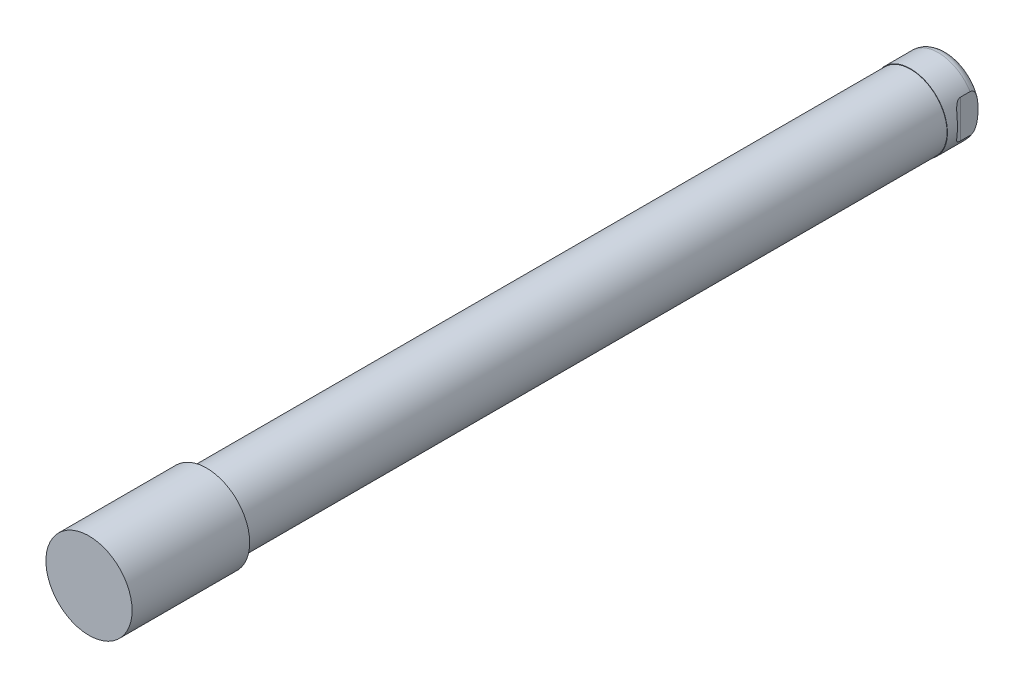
ISO-10303-21;
HEADER;
FILE_DESCRIPTION(('STEP AP214'),'2;1');
FILE_NAME('part.step','',(''),(''),'','','');
FILE_SCHEMA(('AUTOMOTIVE_DESIGN { 1 0 10303 214 1 1 1 1 }'));
ENDSEC;
DATA;
#1=APPLICATION_CONTEXT('core data for automotive mechanical design processes');
#2=APPLICATION_PROTOCOL_DEFINITION('international standard','automotive_design',2000,#1);
#3=PRODUCT_CONTEXT('',#1,'mechanical');
#4=PRODUCT('Part','Part','',(#3));
#5=PRODUCT_RELATED_PRODUCT_CATEGORY('part','',(#4));
#6=PRODUCT_DEFINITION_FORMATION('','',#4);
#7=PRODUCT_DEFINITION_CONTEXT('part definition',#1,'design');
#8=PRODUCT_DEFINITION('design','',#6,#7);
#9=PRODUCT_DEFINITION_SHAPE('','',#8);
#10=(LENGTH_UNIT() NAMED_UNIT(*) SI_UNIT(.MILLI.,.METRE.));
#11=(NAMED_UNIT(*) PLANE_ANGLE_UNIT() SI_UNIT($,.RADIAN.));
#12=(NAMED_UNIT(*) SI_UNIT($,.STERADIAN.) SOLID_ANGLE_UNIT());
#13=UNCERTAINTY_MEASURE_WITH_UNIT(LENGTH_MEASURE(1.E-05),#10,'distance_accuracy_value','');
#14=(GEOMETRIC_REPRESENTATION_CONTEXT(3) GLOBAL_UNCERTAINTY_ASSIGNED_CONTEXT((#13)) GLOBAL_UNIT_ASSIGNED_CONTEXT((#10,
#11,#12)) REPRESENTATION_CONTEXT('',''));
#15=CARTESIAN_POINT('',(0.,0.,0.));
#16=DIRECTION('',(0.,0.,1.));
#17=DIRECTION('',(1.,0.,0.));
#18=AXIS2_PLACEMENT_3D('',#15,#16,#17);
#19=CARTESIAN_POINT('',(0.,9.8171,-245.0973999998));
#20=DIRECTION('',(0.,0.,-1.));
#21=DIRECTION('',(-1.,0.,0.));
#22=AXIS2_PLACEMENT_3D('',#19,#20,#21);
#23=PLANE('',#22);
#24=CARTESIAN_POINT('',(0.,0.,-245.0973999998));
#25=DIRECTION('',(0.,0.,-1.));
#26=DIRECTION('',(-1.,0.,0.));
#27=AXIS2_PLACEMENT_3D('',#24,#25,#26);
#28=CIRCLE('',#27,12.69238);
#29=CARTESIAN_POINT('',(-12.69238,0.,-245.0973999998));
#30=VERTEX_POINT('',#29);
#31=EDGE_CURVE('E10',#30,#30,#28,.F.);
#32=ORIENTED_EDGE('',*,*,#31,.F.);
#33=EDGE_LOOP('',(#32));
#34=FACE_BOUND('',#33,.T.);
#35=CARTESIAN_POINT('',(0.,0.,-245.0973999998));
#36=DIRECTION('',(0.,0.,-1.));
#37=DIRECTION('',(-1.,0.,0.));
#38=AXIS2_PLACEMENT_3D('',#35,#36,#37);
#39=CIRCLE('',#38,12.827);
#40=CARTESIAN_POINT('',(-12.827,0.,-245.0973999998));
#41=VERTEX_POINT('',#40);
#42=EDGE_CURVE('E74',#41,#41,#39,.F.);
#43=ORIENTED_EDGE('',*,*,#42,.T.);
#44=EDGE_LOOP('',(#43));
#45=FACE_BOUND('',#44,.T.);
#46=ADVANCED_FACE('F16',(#34,#45),#23,.F.);
#47=CARTESIAN_POINT('',(0.,0.,-236.058911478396));
#48=DIRECTION('',(0.,0.,-1.));
#49=DIRECTION('',(-1.,0.,0.));
#50=AXIS2_PLACEMENT_3D('',#47,#48,#49);
#51=CONICAL_SURFACE('',#50,0.,1.02974425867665);
#52=CARTESIAN_POINT('',(0.,0.,-239.2973999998));
#53=DIRECTION('',(0.,0.,1.));
#54=DIRECTION('',(1.,0.,0.));
#55=AXIS2_PLACEMENT_3D('',#52,#53,#54);
#56=CIRCLE('',#55,5.38975);
#57=CARTESIAN_POINT('',(5.38975,0.,-239.2973999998));
#58=VERTEX_POINT('',#57);
#59=EDGE_CURVE('E89',#58,#58,#56,.T.);
#60=ORIENTED_EDGE('',*,*,#59,.F.);
#61=EDGE_LOOP('',(#60));
#62=FACE_BOUND('',#61,.T.);
#63=CARTESIAN_POINT('',(0.,0.,-236.058911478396));
#64=VERTEX_POINT('',#63);
#65=VERTEX_LOOP('',#64);
#66=FACE_BOUND('',#65,.T.);
#67=ADVANCED_FACE('F125',(#62,#66),#51,.F.);
#68=CARTESIAN_POINT('',(0.,0.,-219.953809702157));
#69=DIRECTION('',(0.,0.,1.));
#70=DIRECTION('',(1.,0.,0.));
#71=AXIS2_PLACEMENT_3D('',#68,#69,#70);
#72=CYLINDRICAL_SURFACE('',#71,5.38975);
#73=CARTESIAN_POINT('',(0.,0.,-257.0971499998));
#74=DIRECTION('',(0.,0.,1.));
#75=DIRECTION('',(1.,0.,0.));
#76=AXIS2_PLACEMENT_3D('',#73,#74,#75);
#77=CIRCLE('',#76,5.38975);
#78=CARTESIAN_POINT('',(5.38975,0.,-257.0971499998));
#79=VERTEX_POINT('',#78);
#80=EDGE_CURVE('E92',#79,#79,#77,.T.);
#81=ORIENTED_EDGE('',*,*,#80,.F.);
#82=EDGE_LOOP('',(#81));
#83=FACE_BOUND('',#82,.T.);
#84=ORIENTED_EDGE('',*,*,#59,.T.);
#85=EDGE_LOOP('',(#84));
#86=FACE_BOUND('',#85,.T.);
#87=ADVANCED_FACE('F128',(#83,#86),#72,.F.);
#88=CARTESIAN_POINT('',(0.,0.,-257.0971499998));
#89=DIRECTION('',(0.,0.,-1.));
#90=DIRECTION('',(-1.,0.,0.));
#91=AXIS2_PLACEMENT_3D('',#88,#89,#90);
#92=CONICAL_SURFACE('',#91,5.38975,0.785398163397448);
#93=CARTESIAN_POINT('',(0.,0.,-257.7973999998));
#94=DIRECTION('',(0.,0.,1.));
#95=DIRECTION('',(1.,0.,0.));
#96=AXIS2_PLACEMENT_3D('',#93,#94,#95);
#97=CIRCLE('',#96,6.09);
#98=CARTESIAN_POINT('',(6.09,0.,-257.7973999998));
#99=VERTEX_POINT('',#98);
#100=EDGE_CURVE('E95',#99,#99,#97,.T.);
#101=ORIENTED_EDGE('',*,*,#100,.F.);
#102=EDGE_LOOP('',(#101));
#103=FACE_BOUND('',#102,.T.);
#104=ORIENTED_EDGE('',*,*,#80,.T.);
#105=EDGE_LOOP('',(#104));
#106=FACE_BOUND('',#105,.T.);
#107=ADVANCED_FACE('F132',(#103,#106),#92,.F.);
#108=CARTESIAN_POINT('',(0.,9.827,-257.7973999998));
#109=DIRECTION('',(0.,0.,1.));
#110=DIRECTION('',(1.,0.,0.));
#111=AXIS2_PLACEMENT_3D('',#108,#109,#110);
#112=PLANE('',#111);
#113=CARTESIAN_POINT('',(0.,0.,-257.7973999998));
#114=DIRECTION('',(0.,0.,1.));
#115=DIRECTION('',(1.,0.,0.));
#116=AXIS2_PLACEMENT_3D('',#113,#114,#115);
#117=CIRCLE('',#116,9.827);
#118=CARTESIAN_POINT('',(9.827,0.,-257.7973999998));
#119=VERTEX_POINT('',#118);
#120=EDGE_CURVE('E98',#119,#119,#117,.T.);
#121=ORIENTED_EDGE('',*,*,#120,.F.);
#122=EDGE_LOOP('',(#121));
#123=FACE_BOUND('',#122,.T.);
#124=ORIENTED_EDGE('',*,*,#100,.T.);
#125=EDGE_LOOP('',(#124));
#126=FACE_BOUND('',#125,.T.);
#127=ADVANCED_FACE('F135',(#123,#126),#112,.F.);
#128=CARTESIAN_POINT('',(14.175,-13.589,-251.4473999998));
#129=DIRECTION('',(0.,1.,0.));
#130=DIRECTION('',(0.,0.,1.));
#131=AXIS2_PLACEMENT_3D('',#128,#129,#130);
#132=CYLINDRICAL_SURFACE('',#131,3.175);
#133=DIRECTION('',(0.,1.,0.));
#134=VECTOR('',#133,1.);
#135=CARTESIAN_POINT('',(11.,-13.589,-251.4473999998));
#136=LINE('',#135,#134);
#137=CARTESIAN_POINT('',(11.,-6.59787306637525,-251.4473999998));
#138=VERTEX_POINT('',#137);
#139=CARTESIAN_POINT('',(11.,6.59787306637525,-251.4473999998));
#140=VERTEX_POINT('',#139);
#141=EDGE_CURVE('E66',#138,#140,#136,.T.);
#142=ORIENTED_EDGE('',*,*,#141,.T.);
#143=CARTESIAN_POINT('',(12.827,0.,-254.322034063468));
#144=CARTESIAN_POINT('',(12.8270006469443,-0.26870639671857,-254.322032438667));
#145=CARTESIAN_POINT('',(12.8185521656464,-0.537405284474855,-254.318117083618));
#146=CARTESIAN_POINT('',(12.7848168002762,-1.07356137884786,-254.301935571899));
#147=CARTESIAN_POINT('',(12.7595266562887,-1.34101833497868,-254.289667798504));
#148=CARTESIAN_POINT('',(12.6924264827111,-1.87235964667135,-254.255249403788));
#149=CARTESIAN_POINT('',(12.6506688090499,-2.13625260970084,-254.233130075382));
#150=CARTESIAN_POINT('',(12.551075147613,-2.65955990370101,-254.176285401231));
#151=CARTESIAN_POINT('',(12.4932481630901,-2.91897665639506,-254.141567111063));
#152=CARTESIAN_POINT('',(12.3955653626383,-3.30135352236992,-254.077171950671));
#153=CARTESIAN_POINT('',(12.3614412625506,-3.42688052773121,-254.053847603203));
#154=CARTESIAN_POINT('',(12.2896809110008,-3.67592818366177,-254.002425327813));
#155=CARTESIAN_POINT('',(12.2520453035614,-3.79944919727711,-253.974328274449));
#156=CARTESIAN_POINT('',(12.1733916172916,-4.04438579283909,-253.912495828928));
#157=CARTESIAN_POINT('',(12.1323645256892,-4.1657946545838,-253.878745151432));
#158=CARTESIAN_POINT('',(12.0473665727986,-4.40557163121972,-253.804724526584));
#159=CARTESIAN_POINT('',(12.0033958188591,-4.52393985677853,-253.764454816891));
#160=CARTESIAN_POINT('',(11.9123351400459,-4.75859923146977,-253.675645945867));
#161=CARTESIAN_POINT('',(11.8652086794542,-4.87483370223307,-253.626993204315));
#162=CARTESIAN_POINT('',(11.7691575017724,-5.10236285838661,-253.520488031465));
#163=CARTESIAN_POINT('',(11.7202319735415,-5.21365526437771,-253.462631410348));
#164=CARTESIAN_POINT('',(11.621957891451,-5.42917747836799,-253.336568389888));
#165=CARTESIAN_POINT('',(11.5726129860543,-5.53344179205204,-253.268418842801));
#166=CARTESIAN_POINT('',(11.4748714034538,-5.73337583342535,-253.120065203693));
#167=CARTESIAN_POINT('',(11.4264734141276,-5.82905822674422,-253.039879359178));
#168=CARTESIAN_POINT('',(11.3379215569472,-5.99930417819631,-252.875456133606));
#169=CARTESIAN_POINT('',(11.2974443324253,-6.07503291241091,-252.792615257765));
#170=CARTESIAN_POINT('',(11.2211290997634,-6.21486401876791,-252.61554189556));
#171=CARTESIAN_POINT('',(11.1852916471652,-6.27896499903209,-252.521308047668));
#172=CARTESIAN_POINT('',(11.1206016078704,-6.39284793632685,-252.320611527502));
#173=CARTESIAN_POINT('',(11.0918341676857,-6.44245658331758,-252.21402058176));
#174=CARTESIAN_POINT('',(11.0449485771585,-6.52251798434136,-251.991669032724));
#175=CARTESIAN_POINT('',(11.0268129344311,-6.55300220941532,-251.875923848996));
#176=CARTESIAN_POINT('',(11.0050476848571,-6.58948010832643,-251.654354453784));
#177=CARTESIAN_POINT('',(10.9998823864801,-6.59806860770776,-251.549109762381));
#178=CARTESIAN_POINT('',(11.0001214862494,-6.59767106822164,-251.338676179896));
#179=CARTESIAN_POINT('',(11.0055222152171,-6.5886911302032,-251.233487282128));
#180=CARTESIAN_POINT('',(11.0249837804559,-6.55606201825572,-251.039506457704));
#181=CARTESIAN_POINT('',(11.0379211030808,-6.53431349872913,-250.950267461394));
#182=CARTESIAN_POINT('',(11.0703780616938,-6.47917273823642,-250.776769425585));
#183=CARTESIAN_POINT('',(11.0898991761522,-6.44577788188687,-250.692511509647));
#184=CARTESIAN_POINT('',(11.142561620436,-6.354443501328,-250.49957879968));
#185=CARTESIAN_POINT('',(11.1780628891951,-6.29199722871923,-250.39368729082));
#186=CARTESIAN_POINT('',(11.2555606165,-6.15228870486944,-250.194819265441));
#187=CARTESIAN_POINT('',(11.2975704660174,-6.07499582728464,-250.101870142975));
#188=CARTESIAN_POINT('',(11.3740280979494,-5.93028966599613,-249.950595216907));
#189=CARTESIAN_POINT('',(11.407695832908,-5.86533333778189,-249.889463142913));
#190=CARTESIAN_POINT('',(11.4761103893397,-5.73031794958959,-249.773738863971));
#191=CARTESIAN_POINT('',(11.5108577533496,-5.66025629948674,-249.719150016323));
#192=CARTESIAN_POINT('',(11.580721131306,-5.51591033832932,-249.615943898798));
#193=CARTESIAN_POINT('',(11.6158375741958,-5.44162053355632,-249.567334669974));
#194=CARTESIAN_POINT('',(11.6858415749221,-5.28961727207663,-249.475588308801));
#195=CARTESIAN_POINT('',(11.7207290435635,-5.21190256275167,-249.432453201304));
#196=CARTESIAN_POINT('',(11.8154406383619,-4.99498140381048,-249.320954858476));
#197=CARTESIAN_POINT('',(11.8745797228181,-4.85289540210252,-249.257592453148));
#198=CARTESIAN_POINT('',(11.9891935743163,-4.56241341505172,-249.143181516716));
#199=CARTESIAN_POINT('',(12.0446655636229,-4.41401278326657,-249.092142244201));
#200=CARTESIAN_POINT('',(12.1510125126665,-4.11223366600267,-249.000147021));
#201=CARTESIAN_POINT('',(12.2018792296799,-3.95884689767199,-248.959208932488));
#202=CARTESIAN_POINT('',(12.2982733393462,-3.64840228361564,-248.885722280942));
#203=CARTESIAN_POINT('',(12.3437989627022,-3.49134324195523,-248.853176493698));
#204=CARTESIAN_POINT('',(12.4233553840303,-3.19567884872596,-248.798936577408));
#205=CARTESIAN_POINT('',(12.4581089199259,-3.05742452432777,-248.776372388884));
#206=CARTESIAN_POINT('',(12.5231131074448,-2.77920652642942,-248.735692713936));
#207=CARTESIAN_POINT('',(12.553363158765,-2.63924262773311,-248.717577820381));
#208=CARTESIAN_POINT('',(12.6371794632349,-2.21717598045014,-248.668915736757));
#209=CARTESIAN_POINT('',(12.6837855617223,-1.93299577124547,-248.644067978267));
#210=CARTESIAN_POINT('',(12.7578770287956,-1.36086538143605,-248.605904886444));
#211=CARTESIAN_POINT('',(12.7853224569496,-1.07290859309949,-248.592613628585));
#212=CARTESIAN_POINT('',(12.8206829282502,-0.49559522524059,-248.575669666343));
#213=CARTESIAN_POINT('',(12.8286032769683,-0.206239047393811,-248.572014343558));
#214=CARTESIAN_POINT('',(12.8247765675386,0.385076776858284,-248.573808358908));
#215=CARTESIAN_POINT('',(12.8121465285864,0.687029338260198,-248.579666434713));
#216=CARTESIAN_POINT('',(12.76563105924,1.28908038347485,-248.602228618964));
#217=CARTESIAN_POINT('',(12.7317365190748,1.58917801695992,-248.618937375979));
#218=CARTESIAN_POINT('',(12.6653524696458,2.03551310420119,-248.654161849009));
#219=CARTESIAN_POINT('',(12.640698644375,2.18336505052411,-248.667560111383));
#220=CARTESIAN_POINT('',(12.5863116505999,2.47771503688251,-248.698276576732));
#221=CARTESIAN_POINT('',(12.5565791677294,2.62421325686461,-248.715594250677));
#222=CARTESIAN_POINT('',(12.4921854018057,2.9153814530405,-248.754784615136));
#223=CARTESIAN_POINT('',(12.4575282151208,3.06005284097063,-248.776653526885));
#224=CARTESIAN_POINT('',(12.3834551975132,3.34722888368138,-248.825764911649));
#225=CARTESIAN_POINT('',(12.3440405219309,3.48973405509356,-248.853006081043));
#226=CARTESIAN_POINT('',(12.2718676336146,3.73427642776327,-248.905720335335));
#227=CARTESIAN_POINT('',(12.2401497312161,3.83694031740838,-248.929716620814));
#228=CARTESIAN_POINT('',(12.174454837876,4.04054657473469,-248.981594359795));
#229=CARTESIAN_POINT('',(12.1404780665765,4.14148910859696,-249.009475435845));
#230=CARTESIAN_POINT('',(12.0704124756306,4.34146410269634,-249.069696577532));
#231=CARTESIAN_POINT('',(12.0343208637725,4.44049379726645,-249.102042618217));
#232=CARTESIAN_POINT('',(11.9603330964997,4.63608580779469,-249.171776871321));
#233=CARTESIAN_POINT('',(11.9224369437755,4.73264812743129,-249.209165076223));
#234=CARTESIAN_POINT('',(11.8448111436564,4.92372983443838,-249.290082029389));
#235=CARTESIAN_POINT('',(11.8050669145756,5.01821900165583,-249.333668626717));
#236=CARTESIAN_POINT('',(11.7245973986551,5.20345470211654,-249.427505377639));
#237=CARTESIAN_POINT('',(11.6838718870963,5.29420036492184,-249.477757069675));
#238=CARTESIAN_POINT('',(11.6022467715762,5.47076103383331,-249.585645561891));
#239=CARTESIAN_POINT('',(11.5613479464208,5.55658882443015,-249.643261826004));
#240=CARTESIAN_POINT('',(11.4802322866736,5.72229837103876,-249.766831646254));
#241=CARTESIAN_POINT('',(11.4400149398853,5.80218476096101,-249.832778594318));
#242=CARTESIAN_POINT('',(11.3572443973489,5.96271064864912,-249.981494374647));
#243=CARTESIAN_POINT('',(11.3149050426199,6.04250744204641,-250.065309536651));
#244=CARTESIAN_POINT('',(11.2348293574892,6.19012083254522,-250.245033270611));
#245=CARTESIAN_POINT('',(11.1970931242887,6.25793717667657,-250.340942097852));
#246=CARTESIAN_POINT('',(11.128715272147,6.37875529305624,-250.545969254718));
#247=CARTESIAN_POINT('',(11.098168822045,6.43156007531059,-250.655238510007));
#248=CARTESIAN_POINT('',(11.0482516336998,6.51694473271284,-250.883795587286));
#249=CARTESIAN_POINT('',(11.0288594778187,6.54956337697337,-251.003063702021));
#250=CARTESIAN_POINT('',(11.0057736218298,6.58827028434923,-251.229199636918));
#251=CARTESIAN_POINT('',(11.0001989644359,6.59754065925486,-251.335330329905));
#252=CARTESIAN_POINT('',(10.9998120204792,6.59818715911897,-251.547657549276));
#253=CARTESIAN_POINT('',(11.0049956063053,6.58957014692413,-251.653854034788));
#254=CARTESIAN_POINT('',(11.0241644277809,6.55743862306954,-251.848936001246));
#255=CARTESIAN_POINT('',(11.0369358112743,6.53597607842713,-251.938295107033));
#256=CARTESIAN_POINT('',(11.069093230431,6.48136604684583,-252.112068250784));
#257=CARTESIAN_POINT('',(11.0884805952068,6.44821621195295,-252.196481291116));
#258=CARTESIAN_POINT('',(11.1407633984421,6.35759036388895,-252.389422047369));
#259=CARTESIAN_POINT('',(11.176000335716,6.29565265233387,-252.495213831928));
#260=CARTESIAN_POINT('',(11.252993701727,6.15697528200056,-252.693968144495));
#261=CARTESIAN_POINT('',(11.294763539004,6.08020510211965,-252.78690352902));
#262=CARTESIAN_POINT('',(11.370782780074,5.93650304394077,-252.93810818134));
#263=CARTESIAN_POINT('',(11.4042410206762,5.87203904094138,-252.999180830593));
#264=CARTESIAN_POINT('',(11.4722553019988,5.73802693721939,-253.114820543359));
#265=CARTESIAN_POINT('',(11.5068118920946,5.66847626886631,-253.169384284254));
#266=CARTESIAN_POINT('',(11.6110663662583,5.45346713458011,-253.324214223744));
#267=CARTESIAN_POINT('',(11.6812870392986,5.30176672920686,-253.415503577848));
#268=CARTESIAN_POINT('',(11.810013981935,5.00778913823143,-253.567785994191));
#269=CARTESIAN_POINT('',(11.8688574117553,4.86684600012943,-253.631173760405));
#270=CARTESIAN_POINT('',(11.9830054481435,4.57859491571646,-253.745730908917));
#271=CARTESIAN_POINT('',(12.0383073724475,4.43128228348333,-253.796891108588));
#272=CARTESIAN_POINT('',(12.1443997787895,4.13168396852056,-253.889168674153));
#273=CARTESIAN_POINT('',(12.1951815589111,3.9793894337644,-253.9302669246));
#274=CARTESIAN_POINT('',(12.2914956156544,3.67112407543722,-254.00410019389));
#275=CARTESIAN_POINT('',(12.3370261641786,3.51515206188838,-254.036832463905));
#276=CARTESIAN_POINT('',(12.4162972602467,3.22289185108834,-254.091176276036));
#277=CARTESIAN_POINT('',(12.4507928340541,3.08697610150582,-254.113708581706));
#278=CARTESIAN_POINT('',(12.5154354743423,2.81346117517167,-254.154413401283));
#279=CARTESIAN_POINT('',(12.5455819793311,2.67586178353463,-254.172585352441));
#280=CARTESIAN_POINT('',(12.6293223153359,2.26091567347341,-254.221521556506));
#281=CARTESIAN_POINT('',(12.6761913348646,1.98151526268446,-254.246689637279));
#282=CARTESIAN_POINT('',(12.7514128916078,1.41916990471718,-254.285672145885));
#283=CARTESIAN_POINT('',(12.7797420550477,1.13622093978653,-254.299472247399));
#284=CARTESIAN_POINT('',(12.8175325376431,0.568844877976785,-254.317652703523));
#285=CARTESIAN_POINT('',(12.8269993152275,0.284418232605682,-254.322035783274));
#286=CARTESIAN_POINT('',(12.827,0.,-254.322034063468));
#287=B_SPLINE_CURVE_WITH_KNOTS('',3,(#143,#144,#145,#146,#147,#148,#149,#150,#151,#152,#153,
#154,#155,#156,#157,#158,#159,#160,#161,#162,#163,#164,#165,#166,#167,#168,#169,#170,#171,#172,
#173,#174,#175,#176,#177,#178,#179,#180,#181,#182,#183,#184,#185,#186,#187,#188,#189,#190,#191,
#192,#193,#194,#195,#196,#197,#198,#199,#200,#201,#202,#203,#204,#205,#206,#207,#208,#209,#210,
#211,#212,#213,#214,#215,#216,#217,#218,#219,#220,#221,#222,#223,#224,#225,#226,#227,#228,#229,
#230,#231,#232,#233,#234,#235,#236,#237,#238,#239,#240,#241,#242,#243,#244,#245,#246,#247,#248,
#249,#250,#251,#252,#253,#254,#255,#256,#257,#258,#259,#260,#261,#262,#263,#264,#265,#266,#267,
#268,#269,#270,#271,#272,#273,#274,#275,#276,#277,#278,#279,#280,#281,#282,#283,#284,#285,#286),
.UNSPECIFIED.,.T.,.F.,(4,2,2,2,2,2,2,2,2,2,2,2,2,2,2,2,2,2,2,2,2,2,2,2,2,2,2,2,2,2,2,2,2,2,2,2,
2,2,2,2,2,2,2,2,2,2,2,2,2,2,2,2,2,2,2,2,2,2,2,2,2,2,2,2,2,2,2,2,2,2,2,4),(0.,0.805944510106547,
1.61204506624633,2.41560315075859,3.21871192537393,3.61506493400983,4.01134539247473,
4.40871507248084,4.80607026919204,5.20930705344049,5.61272792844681,6.01399694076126,
6.41466364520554,6.77161676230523,7.12861257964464,7.48971755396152,7.85022672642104,
8.16546211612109,8.48058805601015,8.7576922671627,9.03485874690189,9.41660872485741,
9.79915482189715,10.0847983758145,10.3705878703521,10.6567575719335,10.9430328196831,
11.4415134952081,11.94036753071,12.44009747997,12.9399925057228,13.3728240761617,
13.8057132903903,14.6717977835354,15.5396822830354,16.4073309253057,17.3132532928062,
18.2195640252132,18.6709220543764,19.1222191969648,19.5731431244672,20.0239577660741,
20.3541623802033,20.6843349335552,21.0149536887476,21.345571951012,21.6795075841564,
22.013520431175,22.3466214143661,22.6794598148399,23.0480879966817,23.4167239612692,
23.7899949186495,24.1625467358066,24.4806188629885,24.7985689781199,25.0757488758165,
25.3529844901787,25.7335319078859,26.114870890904,26.3991682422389,26.6836101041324,
27.2530112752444,27.7484789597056,28.2443175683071,28.7410909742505,29.2380273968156,
29.6639465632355,30.0899206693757,30.942165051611,31.795481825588,32.648551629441),.UNSPECIFIED.);
#288=EDGE_CURVE('E64',#138,#140,#287,.T.);
#289=ORIENTED_EDGE('',*,*,#288,.F.);
#290=EDGE_LOOP('',(#142,#289));
#291=FACE_BOUND('',#290,.T.);
#292=ADVANCED_FACE('F65',(#291),#132,.F.);
#293=CARTESIAN_POINT('',(11.,-13.589,-257.7973999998));
#294=DIRECTION('',(-1.,0.,0.));
#295=DIRECTION('',(0.,0.,1.));
#296=AXIS2_PLACEMENT_3D('',#293,#294,#295);
#297=PLANE('',#296);
#298=CARTESIAN_POINT('',(11.,0.,-257.558572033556));
#299=CARTESIAN_POINT('',(11.,-0.235247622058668,-257.558566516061));
#300=CARTESIAN_POINT('',(11.,-0.470493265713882,-257.555397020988));
#301=CARTESIAN_POINT('',(11.,-0.940835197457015,-257.542316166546));
#302=CARTESIAN_POINT('',(11.,-1.17593146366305,-257.532403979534));
#303=CARTESIAN_POINT('',(11.,-1.64591775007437,-257.504650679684));
#304=CARTESIAN_POINT('',(11.,-1.88080729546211,-257.486801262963));
#305=CARTESIAN_POINT('',(11.,-2.3496112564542,-257.441173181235));
#306=CARTESIAN_POINT('',(11.,-2.58352588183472,-257.413396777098));
#307=CARTESIAN_POINT('',(11.,-2.9989616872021,-257.35240929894));
#308=CARTESIAN_POINT('',(11.,-3.18084229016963,-257.321683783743));
#309=CARTESIAN_POINT('',(11.,-3.54279949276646,-257.250474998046));
#310=CARTESIAN_POINT('',(11.,-3.72287538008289,-257.209988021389));
#311=CARTESIAN_POINT('',(11.,-4.07918992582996,-257.117145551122));
#312=CARTESIAN_POINT('',(11.,-4.25544154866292,-257.064840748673));
#313=CARTESIAN_POINT('',(11.,-4.602797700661,-256.945474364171));
#314=CARTESIAN_POINT('',(11.,-4.77390771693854,-256.878429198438));
#315=CARTESIAN_POINT('',(11.,-5.07702851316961,-256.740171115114));
#316=CARTESIAN_POINT('',(11.,-5.2104192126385,-256.672020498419));
#317=CARTESIAN_POINT('',(11.,-5.46918637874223,-256.521256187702));
#318=CARTESIAN_POINT('',(11.,-5.59455136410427,-256.438622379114));
#319=CARTESIAN_POINT('',(11.,-5.83424377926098,-256.255585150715));
#320=CARTESIAN_POINT('',(11.,-5.94841927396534,-256.154978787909));
#321=CARTESIAN_POINT('',(11.,-6.15698920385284,-255.934977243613));
#322=CARTESIAN_POINT('',(11.,-6.25144900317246,-255.815646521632));
#323=CARTESIAN_POINT('',(11.,-6.38205172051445,-255.605902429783));
#324=CARTESIAN_POINT('',(11.,-6.42688252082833,-255.520904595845));
#325=CARTESIAN_POINT('',(11.,-6.50221817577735,-255.344737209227));
#326=CARTESIAN_POINT('',(11.,-6.53273441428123,-255.253572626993));
#327=CARTESIAN_POINT('',(11.,-6.57724977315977,-255.066596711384));
#328=CARTESIAN_POINT('',(11.,-6.59113988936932,-254.970758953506));
#329=CARTESIAN_POINT('',(11.,-6.60075639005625,-254.778173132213));
#330=CARTESIAN_POINT('',(11.,-6.59648730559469,-254.681425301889));
#331=CARTESIAN_POINT('',(11.,-6.57141197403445,-254.499106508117));
#332=CARTESIAN_POINT('',(11.,-6.5521399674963,-254.413317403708));
#333=CARTESIAN_POINT('',(11.,-6.50034463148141,-254.245879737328));
#334=CARTESIAN_POINT('',(11.,-6.4678172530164,-254.164232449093));
#335=CARTESIAN_POINT('',(11.,-6.37860257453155,-253.979986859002));
#336=CARTESIAN_POINT('',(11.,-6.31747124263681,-253.879544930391));
#337=CARTESIAN_POINT('',(11.,-6.17978674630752,-253.689848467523));
#338=CARTESIAN_POINT('',(11.,-6.10319990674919,-253.600619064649));
#339=CARTESIAN_POINT('',(11.,-5.89835405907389,-253.392212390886));
#340=CARTESIAN_POINT('',(11.,-5.76319645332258,-253.279863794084));
#341=CARTESIAN_POINT('',(11.,-5.47762736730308,-253.077113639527));
#342=CARTESIAN_POINT('',(11.,-5.32719553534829,-252.986741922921));
#343=CARTESIAN_POINT('',(11.,-5.0309603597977,-252.83163530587));
#344=CARTESIAN_POINT('',(11.,-4.88596547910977,-252.765322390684));
#345=CARTESIAN_POINT('',(11.,-4.59078239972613,-252.645296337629));
#346=CARTESIAN_POINT('',(11.,-4.44058958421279,-252.591594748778));
#347=CARTESIAN_POINT('',(11.,-4.13619184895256,-252.49449924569));
#348=CARTESIAN_POINT('',(11.,-3.98197150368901,-252.451154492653));
#349=CARTESIAN_POINT('',(11.,-3.67143699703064,-252.373321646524));
#350=CARTESIAN_POINT('',(11.,-3.51512398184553,-252.338828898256));
#351=CARTESIAN_POINT('',(11.,-3.1005143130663,-252.257399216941));
#352=CARTESIAN_POINT('',(11.,-2.841012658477,-252.216638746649));
#353=CARTESIAN_POINT('',(11.,-2.32008586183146,-252.149670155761));
#354=CARTESIAN_POINT('',(11.,-2.05865958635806,-252.12347144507));
#355=CARTESIAN_POINT('',(11.,-1.53417590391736,-252.082090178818));
#356=CARTESIAN_POINT('',(11.,-1.27111595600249,-252.066940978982));
#357=CARTESIAN_POINT('',(11.,-0.744724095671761,-252.045581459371));
#358=CARTESIAN_POINT('',(11.,-0.481392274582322,-252.039368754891));
#359=CARTESIAN_POINT('',(11.,0.0455988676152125,-252.034922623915));
#360=CARTESIAN_POINT('',(11.,0.309258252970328,-252.036697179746));
#361=CARTESIAN_POINT('',(11.,0.836458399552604,-252.048519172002));
#362=CARTESIAN_POINT('',(11.,1.09999912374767,-252.058568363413));
#363=CARTESIAN_POINT('',(11.,1.62584348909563,-252.088418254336));
#364=CARTESIAN_POINT('',(11.,1.88814855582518,-252.108192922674));
#365=CARTESIAN_POINT('',(11.,2.41147381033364,-252.160242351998));
#366=CARTESIAN_POINT('',(11.,2.67249453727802,-252.192511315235));
#367=CARTESIAN_POINT('',(11.,3.09542675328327,-252.258674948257));
#368=CARTESIAN_POINT('',(11.,3.25812392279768,-252.287509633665));
#369=CARTESIAN_POINT('',(11.,3.5819947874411,-252.353201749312));
#370=CARTESIAN_POINT('',(11.,3.74316778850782,-252.390062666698));
#371=CARTESIAN_POINT('',(11.,4.06223074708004,-252.473272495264));
#372=CARTESIAN_POINT('',(11.,4.22013305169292,-252.51957327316));
#373=CARTESIAN_POINT('',(11.,4.53201190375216,-252.623764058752));
#374=CARTESIAN_POINT('',(11.,4.68599115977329,-252.681645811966));
#375=CARTESIAN_POINT('',(11.,4.99410080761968,-252.814047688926));
#376=CARTESIAN_POINT('',(11.,5.1479887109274,-252.889142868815));
#377=CARTESIAN_POINT('',(11.,5.44570190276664,-253.057817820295));
#378=CARTESIAN_POINT('',(11.,5.58952250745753,-253.151406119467));
#379=CARTESIAN_POINT('',(11.,5.83221957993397,-253.338478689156));
#380=CARTESIAN_POINT('',(11.,5.93420267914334,-253.42788521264));
#381=CARTESIAN_POINT('',(11.,6.12294376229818,-253.62156928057));
#382=CARTESIAN_POINT('',(11.,6.20973462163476,-253.725813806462));
#383=CARTESIAN_POINT('',(11.,6.34141679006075,-253.919255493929));
#384=CARTESIAN_POINT('',(11.,6.39130707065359,-254.005029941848));
#385=CARTESIAN_POINT('',(11.,6.47654954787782,-254.183585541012));
#386=CARTESIAN_POINT('',(11.,6.51191150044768,-254.27636194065));
#387=CARTESIAN_POINT('',(11.,6.56556463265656,-254.467596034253));
#388=CARTESIAN_POINT('',(11.,6.58372131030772,-254.566092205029));
#389=CARTESIAN_POINT('',(11.,6.60072658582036,-254.764733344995));
#390=CARTESIAN_POINT('',(11.,6.59958533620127,-254.864877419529));
#391=CARTESIAN_POINT('',(11.,6.57940404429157,-255.051535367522));
#392=CARTESIAN_POINT('',(11.,6.56245104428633,-255.138285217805));
#393=CARTESIAN_POINT('',(11.,6.51486797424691,-255.307916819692));
#394=CARTESIAN_POINT('',(11.,6.48423316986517,-255.390797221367));
#395=CARTESIAN_POINT('',(11.,6.40020486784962,-255.575207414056));
#396=CARTESIAN_POINT('',(11.,6.34274152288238,-255.674877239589));
#397=CARTESIAN_POINT('',(11.,6.21243394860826,-255.863566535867));
#398=CARTESIAN_POINT('',(11.,6.13956118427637,-255.952565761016));
#399=CARTESIAN_POINT('',(11.,5.94530576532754,-256.159340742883));
#400=CARTESIAN_POINT('',(11.,5.81727690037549,-256.270829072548));
#401=CARTESIAN_POINT('',(11.,5.54582767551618,-256.472917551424));
#402=CARTESIAN_POINT('',(11.,5.40237638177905,-256.563474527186));
#403=CARTESIAN_POINT('',(11.,5.1214409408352,-256.718333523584));
#404=CARTESIAN_POINT('',(11.,4.98490407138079,-256.784391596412));
#405=CARTESIAN_POINT('',(11.,4.70661680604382,-256.904584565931));
#406=CARTESIAN_POINT('',(11.,4.56486202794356,-256.95870916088));
#407=CARTESIAN_POINT('',(11.,4.27765571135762,-257.056997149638));
#408=CARTESIAN_POINT('',(11.,4.13219693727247,-257.101139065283));
#409=CARTESIAN_POINT('',(11.,3.83894997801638,-257.180964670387));
#410=CARTESIAN_POINT('',(11.,3.69116092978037,-257.216645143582));
#411=CARTESIAN_POINT('',(11.,3.39760623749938,-257.280129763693));
#412=CARTESIAN_POINT('',(11.,3.25187625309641,-257.308101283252));
#413=CARTESIAN_POINT('',(11.,2.95942360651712,-257.358332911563));
#414=CARTESIAN_POINT('',(11.,2.81270078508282,-257.3805920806));
#415=CARTESIAN_POINT('',(11.,2.51851404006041,-257.420289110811));
#416=CARTESIAN_POINT('',(11.,2.3710496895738,-257.437723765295));
#417=CARTESIAN_POINT('',(11.,2.07568722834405,-257.468468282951));
#418=CARTESIAN_POINT('',(11.,1.92778908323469,-257.481777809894));
#419=CARTESIAN_POINT('',(11.,1.4837048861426,-257.516420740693));
#420=CARTESIAN_POINT('',(11.,1.18710469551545,-257.532471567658));
#421=CARTESIAN_POINT('',(11.,0.593668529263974,-257.553548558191));
#422=CARTESIAN_POINT('',(11.,0.296832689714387,-257.558578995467));
#423=CARTESIAN_POINT('',(11.,0.,-257.558572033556));
#424=B_SPLINE_CURVE_WITH_KNOTS('',3,(#298,#299,#300,#301,#302,#303,#304,#305,#306,#307,#308,
#309,#310,#311,#312,#313,#314,#315,#316,#317,#318,#319,#320,#321,#322,#323,#324,#325,#326,#327,
#328,#329,#330,#331,#332,#333,#334,#335,#336,#337,#338,#339,#340,#341,#342,#343,#344,#345,#346,
#347,#348,#349,#350,#351,#352,#353,#354,#355,#356,#357,#358,#359,#360,#361,#362,#363,#364,#365,
#366,#367,#368,#369,#370,#371,#372,#373,#374,#375,#376,#377,#378,#379,#380,#381,#382,#383,#384,
#385,#386,#387,#388,#389,#390,#391,#392,#393,#394,#395,#396,#397,#398,#399,#400,#401,#402,#403,
#404,#405,#406,#407,#408,#409,#410,#411,#412,#413,#414,#415,#416,#417,#418,#419,#420,#421,#422,
#423),.UNSPECIFIED.,.T.,.F.,(4,2,2,2,2,2,2,2,2,2,2,2,2,2,2,2,2,2,2,2,2,2,2,2,2,2,2,2,2,2,2,2,2,
2,2,2,2,2,2,2,2,2,2,2,2,2,2,2,2,2,2,2,2,2,2,2,2,2,2,2,2,2,4),(0.,0.70571666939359,
1.41151997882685,2.1180634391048,2.82444608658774,3.37761348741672,3.93099124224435,
4.48203895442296,5.03247604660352,5.48114601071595,5.93044410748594,6.38517954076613,
6.83838254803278,7.12560301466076,7.41259467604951,7.70145778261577,7.99024881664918,
8.25285984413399,8.51555114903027,8.86633809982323,9.21789777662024,9.74220461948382,
10.267219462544,10.7448305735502,11.2228773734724,11.7031501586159,12.1831698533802,
12.9705914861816,13.7585213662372,14.5488200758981,15.338907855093,16.1297854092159,
16.9208307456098,17.709770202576,18.4983440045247,18.9938849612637,19.4896416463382,
19.982931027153,20.4758700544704,20.9886142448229,21.5015954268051,21.907212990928,
22.3119416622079,22.6085194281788,22.9048977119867,23.2035742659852,23.5020936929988,
23.7660600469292,24.0301178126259,24.3733550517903,24.7172335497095,25.2236859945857,
25.7311739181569,26.1855381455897,26.6402930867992,27.0960173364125,27.5519145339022,
27.9969520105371,28.4420626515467,28.887468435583,29.3329105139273,30.2237210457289,
31.1141860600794),.UNSPECIFIED.);
#425=CARTESIAN_POINT('',(11.,6.59787306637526,-254.7973999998));
#426=VERTEX_POINT('',#425);
#427=CARTESIAN_POINT('',(11.,-6.59787306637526,-254.7973999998));
#428=VERTEX_POINT('',#427);
#429=EDGE_CURVE('E103',#426,#428,#424,.T.);
#430=ORIENTED_EDGE('',*,*,#429,.F.);
#431=DIRECTION('',(0.,0.,1.));
#432=VECTOR('',#431,1.);
#433=CARTESIAN_POINT('',(11.,6.59787306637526,-219.953809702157));
#434=LINE('',#433,#432);
#435=EDGE_CURVE('E72',#140,#426,#434,.F.);
#436=ORIENTED_EDGE('',*,*,#435,.F.);
#437=ORIENTED_EDGE('',*,*,#141,.F.);
#438=DIRECTION('',(0.,0.,1.));
#439=VECTOR('',#438,1.);
#440=CARTESIAN_POINT('',(11.,-6.59787306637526,-219.953809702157));
#441=LINE('',#440,#439);
#442=EDGE_CURVE('E33',#428,#138,#441,.T.);
#443=ORIENTED_EDGE('',*,*,#442,.F.);
#444=EDGE_LOOP('',(#430,#436,#437,#443));
#445=FACE_BOUND('',#444,.T.);
#446=ADVANCED_FACE('F71',(#445),#297,.F.);
#447=CARTESIAN_POINT('',(-14.175,-13.589,-251.4473999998));
#448=DIRECTION('',(0.,1.,0.));
#449=DIRECTION('',(0.,0.,1.));
#450=AXIS2_PLACEMENT_3D('',#447,#448,#449);
#451=CYLINDRICAL_SURFACE('',#450,3.175);
#452=DIRECTION('',(0.,1.,0.));
#453=VECTOR('',#452,1.);
#454=CARTESIAN_POINT('',(-11.,-13.589,-251.4473999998));
#455=LINE('',#454,#453);
#456=CARTESIAN_POINT('',(-11.,-6.59787306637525,-251.4473999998));
#457=VERTEX_POINT('',#456);
#458=CARTESIAN_POINT('',(-11.,6.59787306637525,-251.4473999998));
#459=VERTEX_POINT('',#458);
#460=EDGE_CURVE('E73',#457,#459,#455,.T.);
#461=ORIENTED_EDGE('',*,*,#460,.F.);
#462=CARTESIAN_POINT('',(-12.827,0.,-254.322034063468));
#463=CARTESIAN_POINT('',(-12.8270006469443,0.26870639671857,-254.322032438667));
#464=CARTESIAN_POINT('',(-12.8185521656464,0.537405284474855,-254.318117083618));
#465=CARTESIAN_POINT('',(-12.7848168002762,1.07356137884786,-254.301935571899));
#466=CARTESIAN_POINT('',(-12.7595266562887,1.34101833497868,-254.289667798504));
#467=CARTESIAN_POINT('',(-12.6924264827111,1.87235964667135,-254.255249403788));
#468=CARTESIAN_POINT('',(-12.6506688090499,2.13625260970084,-254.233130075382));
#469=CARTESIAN_POINT('',(-12.551075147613,2.65955990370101,-254.176285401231));
#470=CARTESIAN_POINT('',(-12.4932481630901,2.91897665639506,-254.141567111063));
#471=CARTESIAN_POINT('',(-12.3955653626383,3.30135352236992,-254.077171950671));
#472=CARTESIAN_POINT('',(-12.3614412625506,3.42688052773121,-254.053847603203));
#473=CARTESIAN_POINT('',(-12.2896809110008,3.67592818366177,-254.002425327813));
#474=CARTESIAN_POINT('',(-12.2520453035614,3.79944919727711,-253.974328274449));
#475=CARTESIAN_POINT('',(-12.1733916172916,4.04438579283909,-253.912495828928));
#476=CARTESIAN_POINT('',(-12.1323645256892,4.1657946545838,-253.878745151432));
#477=CARTESIAN_POINT('',(-12.0473665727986,4.40557163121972,-253.804724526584));
#478=CARTESIAN_POINT('',(-12.0033958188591,4.52393985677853,-253.764454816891));
#479=CARTESIAN_POINT('',(-11.9123351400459,4.75859923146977,-253.675645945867));
#480=CARTESIAN_POINT('',(-11.8652086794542,4.87483370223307,-253.626993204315));
#481=CARTESIAN_POINT('',(-11.7691575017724,5.10236285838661,-253.520488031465));
#482=CARTESIAN_POINT('',(-11.7202319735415,5.21365526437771,-253.462631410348));
#483=CARTESIAN_POINT('',(-11.621957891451,5.42917747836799,-253.336568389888));
#484=CARTESIAN_POINT('',(-11.5726129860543,5.53344179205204,-253.268418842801));
#485=CARTESIAN_POINT('',(-11.4748714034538,5.73337583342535,-253.120065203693));
#486=CARTESIAN_POINT('',(-11.4264734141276,5.82905822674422,-253.039879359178));
#487=CARTESIAN_POINT('',(-11.3379215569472,5.99930417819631,-252.875456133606));
#488=CARTESIAN_POINT('',(-11.2974443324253,6.07503291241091,-252.792615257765));
#489=CARTESIAN_POINT('',(-11.2211290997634,6.21486401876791,-252.61554189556));
#490=CARTESIAN_POINT('',(-11.1852916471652,6.27896499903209,-252.521308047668));
#491=CARTESIAN_POINT('',(-11.1206016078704,6.39284793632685,-252.320611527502));
#492=CARTESIAN_POINT('',(-11.0918341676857,6.44245658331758,-252.21402058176));
#493=CARTESIAN_POINT('',(-11.0449485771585,6.52251798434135,-251.991669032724));
#494=CARTESIAN_POINT('',(-11.0268129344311,6.55300220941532,-251.875923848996));
#495=CARTESIAN_POINT('',(-11.0050476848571,6.58948010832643,-251.654354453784));
#496=CARTESIAN_POINT('',(-10.9998823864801,6.59806860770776,-251.549109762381));
#497=CARTESIAN_POINT('',(-11.0001214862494,6.59767106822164,-251.338676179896));
#498=CARTESIAN_POINT('',(-11.0055222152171,6.5886911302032,-251.233487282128));
#499=CARTESIAN_POINT('',(-11.0249837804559,6.55606201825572,-251.039506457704));
#500=CARTESIAN_POINT('',(-11.0379211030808,6.53431349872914,-250.950267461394));
#501=CARTESIAN_POINT('',(-11.0703780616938,6.47917273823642,-250.776769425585));
#502=CARTESIAN_POINT('',(-11.0898991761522,6.44577788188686,-250.692511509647));
#503=CARTESIAN_POINT('',(-11.142561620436,6.35444350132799,-250.49957879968));
#504=CARTESIAN_POINT('',(-11.178062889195,6.29199722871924,-250.39368729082));
#505=CARTESIAN_POINT('',(-11.2555606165,6.15228870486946,-250.194819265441));
#506=CARTESIAN_POINT('',(-11.2975704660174,6.07499582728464,-250.101870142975));
#507=CARTESIAN_POINT('',(-11.3740280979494,5.93028966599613,-249.950595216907));
#508=CARTESIAN_POINT('',(-11.407695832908,5.8653333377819,-249.889463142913));
#509=CARTESIAN_POINT('',(-11.4761103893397,5.73031794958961,-249.773738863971));
#510=CARTESIAN_POINT('',(-11.5108577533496,5.66025629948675,-249.719150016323));
#511=CARTESIAN_POINT('',(-11.580721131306,5.51591033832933,-249.615943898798));
#512=CARTESIAN_POINT('',(-11.6158375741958,5.44162053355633,-249.567334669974));
#513=CARTESIAN_POINT('',(-11.6858415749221,5.28961727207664,-249.475588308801));
#514=CARTESIAN_POINT('',(-11.7207290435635,5.21190256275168,-249.432453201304));
#515=CARTESIAN_POINT('',(-11.8154406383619,4.99498140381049,-249.320954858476));
#516=CARTESIAN_POINT('',(-11.8745797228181,4.85289540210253,-249.257592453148));
#517=CARTESIAN_POINT('',(-11.9891935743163,4.56241341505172,-249.143181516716));
#518=CARTESIAN_POINT('',(-12.0446655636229,4.41401278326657,-249.092142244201));
#519=CARTESIAN_POINT('',(-12.1510125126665,4.11223366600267,-249.000147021));
#520=CARTESIAN_POINT('',(-12.2018792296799,3.95884689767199,-248.959208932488));
#521=CARTESIAN_POINT('',(-12.2982733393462,3.64840228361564,-248.885722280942));
#522=CARTESIAN_POINT('',(-12.3437989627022,3.49134324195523,-248.853176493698));
#523=CARTESIAN_POINT('',(-12.4233553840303,3.19567884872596,-248.798936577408));
#524=CARTESIAN_POINT('',(-12.4581089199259,3.05742452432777,-248.776372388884));
#525=CARTESIAN_POINT('',(-12.5231131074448,2.77920652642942,-248.735692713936));
#526=CARTESIAN_POINT('',(-12.553363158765,2.63924262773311,-248.717577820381));
#527=CARTESIAN_POINT('',(-12.6371794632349,2.21717598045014,-248.668915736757));
#528=CARTESIAN_POINT('',(-12.6837855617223,1.93299577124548,-248.644067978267));
#529=CARTESIAN_POINT('',(-12.7578770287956,1.36086538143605,-248.605904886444));
#530=CARTESIAN_POINT('',(-12.7853224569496,1.07290859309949,-248.592613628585));
#531=CARTESIAN_POINT('',(-12.8206829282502,0.495595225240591,-248.575669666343));
#532=CARTESIAN_POINT('',(-12.8286032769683,0.206239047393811,-248.572014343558));
#533=CARTESIAN_POINT('',(-12.8247765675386,-0.385076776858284,-248.573808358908));
#534=CARTESIAN_POINT('',(-12.8121465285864,-0.687029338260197,-248.579666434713));
#535=CARTESIAN_POINT('',(-12.76563105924,-1.28908038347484,-248.602228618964));
#536=CARTESIAN_POINT('',(-12.7317365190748,-1.58917801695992,-248.618937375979));
#537=CARTESIAN_POINT('',(-12.6653524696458,-2.03551310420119,-248.654161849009));
#538=CARTESIAN_POINT('',(-12.640698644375,-2.18336505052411,-248.667560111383));
#539=CARTESIAN_POINT('',(-12.5863116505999,-2.47771503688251,-248.698276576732));
#540=CARTESIAN_POINT('',(-12.5565791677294,-2.62421325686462,-248.715594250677));
#541=CARTESIAN_POINT('',(-12.4921854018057,-2.91538145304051,-248.754784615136));
#542=CARTESIAN_POINT('',(-12.4575282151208,-3.06005284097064,-248.776653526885));
#543=CARTESIAN_POINT('',(-12.3834551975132,-3.34722888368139,-248.825764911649));
#544=CARTESIAN_POINT('',(-12.3440405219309,-3.48973405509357,-248.853006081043));
#545=CARTESIAN_POINT('',(-12.2718676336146,-3.73427642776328,-248.905720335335));
#546=CARTESIAN_POINT('',(-12.2401497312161,-3.83694031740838,-248.929716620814));
#547=CARTESIAN_POINT('',(-12.174454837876,-4.0405465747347,-248.981594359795));
#548=CARTESIAN_POINT('',(-12.1404780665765,-4.14148910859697,-249.009475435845));
#549=CARTESIAN_POINT('',(-12.0704124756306,-4.34146410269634,-249.069696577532));
#550=CARTESIAN_POINT('',(-12.0343208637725,-4.44049379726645,-249.102042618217));
#551=CARTESIAN_POINT('',(-11.9603330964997,-4.6360858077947,-249.171776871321));
#552=CARTESIAN_POINT('',(-11.9224369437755,-4.7326481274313,-249.209165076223));
#553=CARTESIAN_POINT('',(-11.8448111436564,-4.92372983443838,-249.290082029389));
#554=CARTESIAN_POINT('',(-11.8050669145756,-5.01821900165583,-249.333668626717));
#555=CARTESIAN_POINT('',(-11.7245973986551,-5.20345470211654,-249.427505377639));
#556=CARTESIAN_POINT('',(-11.6838718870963,-5.29420036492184,-249.477757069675));
#557=CARTESIAN_POINT('',(-11.6022467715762,-5.4707610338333,-249.585645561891));
#558=CARTESIAN_POINT('',(-11.5613479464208,-5.55658882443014,-249.643261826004));
#559=CARTESIAN_POINT('',(-11.4802322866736,-5.72229837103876,-249.766831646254));
#560=CARTESIAN_POINT('',(-11.4400149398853,-5.80218476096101,-249.832778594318));
#561=CARTESIAN_POINT('',(-11.3572443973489,-5.96271064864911,-249.981494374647));
#562=CARTESIAN_POINT('',(-11.31490504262,-6.0425074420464,-250.065309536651));
#563=CARTESIAN_POINT('',(-11.2348293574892,-6.19012083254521,-250.245033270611));
#564=CARTESIAN_POINT('',(-11.1970931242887,-6.25793717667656,-250.340942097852));
#565=CARTESIAN_POINT('',(-11.128715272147,-6.37875529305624,-250.545969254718));
#566=CARTESIAN_POINT('',(-11.098168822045,-6.43156007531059,-250.655238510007));
#567=CARTESIAN_POINT('',(-11.0482516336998,-6.51694473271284,-250.883795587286));
#568=CARTESIAN_POINT('',(-11.0288594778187,-6.54956337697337,-251.003063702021));
#569=CARTESIAN_POINT('',(-11.0057736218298,-6.58827028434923,-251.229199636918));
#570=CARTESIAN_POINT('',(-11.0001989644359,-6.59754065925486,-251.335330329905));
#571=CARTESIAN_POINT('',(-10.9998120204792,-6.59818715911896,-251.547657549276));
#572=CARTESIAN_POINT('',(-11.0049956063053,-6.58957014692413,-251.653854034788));
#573=CARTESIAN_POINT('',(-11.0241644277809,-6.55743862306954,-251.848936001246));
#574=CARTESIAN_POINT('',(-11.0369358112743,-6.53597607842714,-251.938295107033));
#575=CARTESIAN_POINT('',(-11.0690932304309,-6.48136604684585,-252.112068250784));
#576=CARTESIAN_POINT('',(-11.0884805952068,-6.44821621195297,-252.196481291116));
#577=CARTESIAN_POINT('',(-11.1407633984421,-6.35759036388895,-252.389422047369));
#578=CARTESIAN_POINT('',(-11.176000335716,-6.29565265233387,-252.495213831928));
#579=CARTESIAN_POINT('',(-11.252993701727,-6.15697528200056,-252.693968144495));
#580=CARTESIAN_POINT('',(-11.294763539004,-6.08020510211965,-252.78690352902));
#581=CARTESIAN_POINT('',(-11.370782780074,-5.93650304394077,-252.93810818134));
#582=CARTESIAN_POINT('',(-11.4042410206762,-5.87203904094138,-252.999180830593));
#583=CARTESIAN_POINT('',(-11.4722553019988,-5.73802693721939,-253.114820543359));
#584=CARTESIAN_POINT('',(-11.5068118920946,-5.66847626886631,-253.169384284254));
#585=CARTESIAN_POINT('',(-11.6110663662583,-5.45346713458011,-253.324214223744));
#586=CARTESIAN_POINT('',(-11.6812870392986,-5.30176672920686,-253.415503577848));
#587=CARTESIAN_POINT('',(-11.810013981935,-5.00778913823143,-253.567785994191));
#588=CARTESIAN_POINT('',(-11.8688574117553,-4.86684600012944,-253.631173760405));
#589=CARTESIAN_POINT('',(-11.9830054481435,-4.57859491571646,-253.745730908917));
#590=CARTESIAN_POINT('',(-12.0383073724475,-4.43128228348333,-253.796891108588));
#591=CARTESIAN_POINT('',(-12.1443997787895,-4.13168396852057,-253.889168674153));
#592=CARTESIAN_POINT('',(-12.1951815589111,-3.97938943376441,-253.9302669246));
#593=CARTESIAN_POINT('',(-12.2914956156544,-3.67112407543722,-254.00410019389));
#594=CARTESIAN_POINT('',(-12.3370261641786,-3.51515206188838,-254.036832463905));
#595=CARTESIAN_POINT('',(-12.4162972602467,-3.22289185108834,-254.091176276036));
#596=CARTESIAN_POINT('',(-12.4507928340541,-3.08697610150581,-254.113708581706));
#597=CARTESIAN_POINT('',(-12.5154354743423,-2.81346117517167,-254.154413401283));
#598=CARTESIAN_POINT('',(-12.5455819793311,-2.67586178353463,-254.172585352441));
#599=CARTESIAN_POINT('',(-12.6293223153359,-2.2609156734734,-254.221521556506));
#600=CARTESIAN_POINT('',(-12.6761913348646,-1.98151526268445,-254.246689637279));
#601=CARTESIAN_POINT('',(-12.7514128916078,-1.41916990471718,-254.285672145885));
#602=CARTESIAN_POINT('',(-12.7797420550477,-1.13622093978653,-254.299472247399));
#603=CARTESIAN_POINT('',(-12.8175325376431,-0.568844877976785,-254.317652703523));
#604=CARTESIAN_POINT('',(-12.8269993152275,-0.284418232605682,-254.322035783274));
#605=CARTESIAN_POINT('',(-12.827,0.,-254.322034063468));
#606=B_SPLINE_CURVE_WITH_KNOTS('',3,(#462,#463,#464,#465,#466,#467,#468,#469,#470,#471,#472,
#473,#474,#475,#476,#477,#478,#479,#480,#481,#482,#483,#484,#485,#486,#487,#488,#489,#490,#491,
#492,#493,#494,#495,#496,#497,#498,#499,#500,#501,#502,#503,#504,#505,#506,#507,#508,#509,#510,
#511,#512,#513,#514,#515,#516,#517,#518,#519,#520,#521,#522,#523,#524,#525,#526,#527,#528,#529,
#530,#531,#532,#533,#534,#535,#536,#537,#538,#539,#540,#541,#542,#543,#544,#545,#546,#547,#548,
#549,#550,#551,#552,#553,#554,#555,#556,#557,#558,#559,#560,#561,#562,#563,#564,#565,#566,#567,
#568,#569,#570,#571,#572,#573,#574,#575,#576,#577,#578,#579,#580,#581,#582,#583,#584,#585,#586,
#587,#588,#589,#590,#591,#592,#593,#594,#595,#596,#597,#598,#599,#600,#601,#602,#603,#604,#605),
.UNSPECIFIED.,.T.,.F.,(4,2,2,2,2,2,2,2,2,2,2,2,2,2,2,2,2,2,2,2,2,2,2,2,2,2,2,2,2,2,2,2,2,2,2,2,
2,2,2,2,2,2,2,2,2,2,2,2,2,2,2,2,2,2,2,2,2,2,2,2,2,2,2,2,2,2,2,2,2,2,2,4),(0.,0.805944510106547,
1.61204506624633,2.41560315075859,3.21871192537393,3.61506493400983,4.01134539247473,
4.40871507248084,4.80607026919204,5.20930705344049,5.61272792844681,6.01399694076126,
6.41466364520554,6.77161676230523,7.12861257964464,7.48971755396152,7.85022672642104,
8.16546211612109,8.48058805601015,8.7576922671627,9.03485874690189,9.4166087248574,
9.79915482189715,10.0847983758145,10.3705878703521,10.6567575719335,10.943032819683,
11.441513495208,11.9403675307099,12.44009747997,12.9399925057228,13.3728240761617,
13.8057132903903,14.6717977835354,15.5396822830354,16.4073309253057,17.3132532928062,
18.2195640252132,18.6709220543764,19.1222191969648,19.5731431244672,20.0239577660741,
20.3541623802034,20.6843349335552,21.0149536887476,21.345571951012,21.6795075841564,
22.013520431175,22.3466214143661,22.6794598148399,23.0480879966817,23.4167239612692,
23.7899949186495,24.1625467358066,24.4806188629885,24.7985689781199,25.0757488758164,
25.3529844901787,25.7335319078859,26.114870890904,26.3991682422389,26.6836101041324,
27.2530112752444,27.7484789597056,28.2443175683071,28.7410909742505,29.2380273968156,
29.6639465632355,30.0899206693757,30.942165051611,31.795481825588,32.648551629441),.UNSPECIFIED.);
#607=EDGE_CURVE('E25',#459,#457,#606,.T.);
#608=ORIENTED_EDGE('',*,*,#607,.F.);
#609=EDGE_LOOP('',(#461,#608));
#610=FACE_BOUND('',#609,.T.);
#611=ADVANCED_FACE('F122',(#610),#451,.F.);
#612=CARTESIAN_POINT('',(-11.,-13.589,-251.4473999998));
#613=DIRECTION('',(1.,0.,0.));
#614=DIRECTION('',(0.,0.,-1.));
#615=AXIS2_PLACEMENT_3D('',#612,#613,#614);
#616=PLANE('',#615);
#617=CARTESIAN_POINT('',(-11.,0.,-257.558572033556));
#618=CARTESIAN_POINT('',(-11.,0.235247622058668,-257.558566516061));
#619=CARTESIAN_POINT('',(-11.,0.470493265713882,-257.555397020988));
#620=CARTESIAN_POINT('',(-11.,0.940835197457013,-257.542316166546));
#621=CARTESIAN_POINT('',(-11.,1.17593146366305,-257.532403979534));
#622=CARTESIAN_POINT('',(-11.,1.64591775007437,-257.504650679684));
#623=CARTESIAN_POINT('',(-11.,1.88080729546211,-257.486801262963));
#624=CARTESIAN_POINT('',(-11.,2.34961125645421,-257.441173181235));
#625=CARTESIAN_POINT('',(-11.,2.58352588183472,-257.413396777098));
#626=CARTESIAN_POINT('',(-11.,2.99896168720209,-257.35240929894));
#627=CARTESIAN_POINT('',(-11.,3.18084229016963,-257.321683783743));
#628=CARTESIAN_POINT('',(-11.,3.54279949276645,-257.250474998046));
#629=CARTESIAN_POINT('',(-11.,3.72287538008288,-257.209988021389));
#630=CARTESIAN_POINT('',(-11.,4.07918992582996,-257.117145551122));
#631=CARTESIAN_POINT('',(-11.,4.25544154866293,-257.064840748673));
#632=CARTESIAN_POINT('',(-11.,4.602797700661,-256.945474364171));
#633=CARTESIAN_POINT('',(-11.,4.77390771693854,-256.878429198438));
#634=CARTESIAN_POINT('',(-11.,5.07702851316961,-256.740171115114));
#635=CARTESIAN_POINT('',(-11.,5.2104192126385,-256.672020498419));
#636=CARTESIAN_POINT('',(-11.,5.46918637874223,-256.521256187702));
#637=CARTESIAN_POINT('',(-11.,5.59455136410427,-256.438622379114));
#638=CARTESIAN_POINT('',(-11.,5.83424377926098,-256.255585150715));
#639=CARTESIAN_POINT('',(-11.,5.94841927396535,-256.154978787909));
#640=CARTESIAN_POINT('',(-11.,6.15698920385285,-255.934977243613));
#641=CARTESIAN_POINT('',(-11.,6.25144900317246,-255.815646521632));
#642=CARTESIAN_POINT('',(-11.,6.38205172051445,-255.605902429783));
#643=CARTESIAN_POINT('',(-11.,6.42688252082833,-255.520904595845));
#644=CARTESIAN_POINT('',(-11.,6.50221817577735,-255.344737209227));
#645=CARTESIAN_POINT('',(-11.,6.53273441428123,-255.253572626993));
#646=CARTESIAN_POINT('',(-11.,6.57724977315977,-255.066596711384));
#647=CARTESIAN_POINT('',(-11.,6.59113988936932,-254.970758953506));
#648=CARTESIAN_POINT('',(-11.,6.60075639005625,-254.778173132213));
#649=CARTESIAN_POINT('',(-11.,6.59648730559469,-254.681425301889));
#650=CARTESIAN_POINT('',(-11.,6.57141197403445,-254.499106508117));
#651=CARTESIAN_POINT('',(-11.,6.5521399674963,-254.413317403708));
#652=CARTESIAN_POINT('',(-11.,6.50034463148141,-254.245879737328));
#653=CARTESIAN_POINT('',(-11.,6.4678172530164,-254.164232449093));
#654=CARTESIAN_POINT('',(-11.,6.37860257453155,-253.979986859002));
#655=CARTESIAN_POINT('',(-11.,6.31747124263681,-253.879544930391));
#656=CARTESIAN_POINT('',(-11.,6.17978674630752,-253.689848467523));
#657=CARTESIAN_POINT('',(-11.,6.10319990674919,-253.600619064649));
#658=CARTESIAN_POINT('',(-11.,5.89835405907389,-253.392212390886));
#659=CARTESIAN_POINT('',(-11.,5.76319645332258,-253.279863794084));
#660=CARTESIAN_POINT('',(-11.,5.47762736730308,-253.077113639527));
#661=CARTESIAN_POINT('',(-11.,5.3271955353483,-252.986741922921));
#662=CARTESIAN_POINT('',(-11.,5.03096035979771,-252.83163530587));
#663=CARTESIAN_POINT('',(-11.,4.88596547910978,-252.765322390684));
#664=CARTESIAN_POINT('',(-11.,4.59078239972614,-252.645296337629));
#665=CARTESIAN_POINT('',(-11.,4.4405895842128,-252.591594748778));
#666=CARTESIAN_POINT('',(-11.,4.13619184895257,-252.49449924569));
#667=CARTESIAN_POINT('',(-11.,3.98197150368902,-252.451154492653));
#668=CARTESIAN_POINT('',(-11.,3.67143699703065,-252.373321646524));
#669=CARTESIAN_POINT('',(-11.,3.51512398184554,-252.338828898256));
#670=CARTESIAN_POINT('',(-11.,3.10051431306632,-252.257399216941));
#671=CARTESIAN_POINT('',(-11.,2.84101265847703,-252.216638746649));
#672=CARTESIAN_POINT('',(-11.,2.32008586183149,-252.149670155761));
#673=CARTESIAN_POINT('',(-11.,2.0586595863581,-252.12347144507));
#674=CARTESIAN_POINT('',(-11.,1.5341759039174,-252.082090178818));
#675=CARTESIAN_POINT('',(-11.,1.27111595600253,-252.066940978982));
#676=CARTESIAN_POINT('',(-11.,0.744724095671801,-252.045581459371));
#677=CARTESIAN_POINT('',(-11.,0.481392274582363,-252.039368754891));
#678=CARTESIAN_POINT('',(-11.,-0.0455988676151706,-252.034922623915));
#679=CARTESIAN_POINT('',(-11.,-0.309258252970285,-252.036697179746));
#680=CARTESIAN_POINT('',(-11.,-0.836458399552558,-252.048519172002));
#681=CARTESIAN_POINT('',(-11.,-1.09999912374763,-252.058568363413));
#682=CARTESIAN_POINT('',(-11.,-1.62584348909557,-252.088418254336));
#683=CARTESIAN_POINT('',(-11.,-1.88814855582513,-252.108192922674));
#684=CARTESIAN_POINT('',(-11.,-2.41147381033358,-252.160242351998));
#685=CARTESIAN_POINT('',(-11.,-2.67249453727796,-252.192511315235));
#686=CARTESIAN_POINT('',(-11.,-3.09542675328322,-252.258674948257));
#687=CARTESIAN_POINT('',(-11.,-3.25812392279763,-252.287509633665));
#688=CARTESIAN_POINT('',(-11.,-3.58199478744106,-252.353201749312));
#689=CARTESIAN_POINT('',(-11.,-3.74316778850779,-252.390062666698));
#690=CARTESIAN_POINT('',(-11.,-4.06223074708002,-252.473272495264));
#691=CARTESIAN_POINT('',(-11.,-4.2201330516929,-252.51957327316));
#692=CARTESIAN_POINT('',(-11.,-4.53201190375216,-252.623764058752));
#693=CARTESIAN_POINT('',(-11.,-4.68599115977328,-252.681645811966));
#694=CARTESIAN_POINT('',(-11.,-4.99410080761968,-252.814047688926));
#695=CARTESIAN_POINT('',(-11.,-5.1479887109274,-252.889142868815));
#696=CARTESIAN_POINT('',(-11.,-5.44570190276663,-253.057817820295));
#697=CARTESIAN_POINT('',(-11.,-5.58952250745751,-253.151406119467));
#698=CARTESIAN_POINT('',(-11.,-5.83221957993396,-253.338478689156));
#699=CARTESIAN_POINT('',(-11.,-5.93420267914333,-253.42788521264));
#700=CARTESIAN_POINT('',(-11.,-6.12294376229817,-253.62156928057));
#701=CARTESIAN_POINT('',(-11.,-6.20973462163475,-253.725813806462));
#702=CARTESIAN_POINT('',(-11.,-6.34141679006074,-253.919255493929));
#703=CARTESIAN_POINT('',(-11.,-6.39130707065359,-254.005029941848));
#704=CARTESIAN_POINT('',(-11.,-6.47654954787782,-254.183585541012));
#705=CARTESIAN_POINT('',(-11.,-6.51191150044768,-254.27636194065));
#706=CARTESIAN_POINT('',(-11.,-6.56556463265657,-254.467596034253));
#707=CARTESIAN_POINT('',(-11.,-6.58372131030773,-254.566092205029));
#708=CARTESIAN_POINT('',(-11.,-6.60072658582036,-254.764733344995));
#709=CARTESIAN_POINT('',(-11.,-6.59958533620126,-254.864877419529));
#710=CARTESIAN_POINT('',(-11.,-6.57940404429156,-255.051535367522));
#711=CARTESIAN_POINT('',(-11.,-6.56245104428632,-255.138285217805));
#712=CARTESIAN_POINT('',(-11.,-6.51486797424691,-255.307916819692));
#713=CARTESIAN_POINT('',(-11.,-6.48423316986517,-255.390797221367));
#714=CARTESIAN_POINT('',(-11.,-6.40020486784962,-255.575207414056));
#715=CARTESIAN_POINT('',(-11.,-6.34274152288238,-255.674877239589));
#716=CARTESIAN_POINT('',(-11.,-6.21243394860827,-255.863566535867));
#717=CARTESIAN_POINT('',(-11.,-6.13956118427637,-255.952565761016));
#718=CARTESIAN_POINT('',(-11.,-5.94530576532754,-256.159340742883));
#719=CARTESIAN_POINT('',(-11.,-5.81727690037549,-256.270829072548));
#720=CARTESIAN_POINT('',(-11.,-5.54582767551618,-256.472917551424));
#721=CARTESIAN_POINT('',(-11.,-5.40237638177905,-256.563474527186));
#722=CARTESIAN_POINT('',(-11.,-5.1214409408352,-256.718333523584));
#723=CARTESIAN_POINT('',(-11.,-4.98490407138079,-256.784391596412));
#724=CARTESIAN_POINT('',(-11.,-4.70661680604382,-256.904584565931));
#725=CARTESIAN_POINT('',(-11.,-4.56486202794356,-256.95870916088));
#726=CARTESIAN_POINT('',(-11.,-4.27765571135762,-257.056997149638));
#727=CARTESIAN_POINT('',(-11.,-4.13219693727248,-257.101139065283));
#728=CARTESIAN_POINT('',(-11.,-3.83894997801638,-257.180964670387));
#729=CARTESIAN_POINT('',(-11.,-3.69116092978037,-257.216645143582));
#730=CARTESIAN_POINT('',(-11.,-3.39760623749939,-257.280129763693));
#731=CARTESIAN_POINT('',(-11.,-3.25187625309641,-257.308101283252));
#732=CARTESIAN_POINT('',(-11.,-2.95942360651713,-257.358332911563));
#733=CARTESIAN_POINT('',(-11.,-2.81270078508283,-257.3805920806));
#734=CARTESIAN_POINT('',(-11.,-2.51851404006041,-257.420289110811));
#735=CARTESIAN_POINT('',(-11.,-2.37104968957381,-257.437723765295));
#736=CARTESIAN_POINT('',(-11.,-2.07568722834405,-257.468468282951));
#737=CARTESIAN_POINT('',(-11.,-1.92778908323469,-257.481777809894));
#738=CARTESIAN_POINT('',(-11.,-1.4837048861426,-257.516420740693));
#739=CARTESIAN_POINT('',(-11.,-1.18710469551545,-257.532471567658));
#740=CARTESIAN_POINT('',(-11.,-0.593668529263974,-257.553548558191));
#741=CARTESIAN_POINT('',(-11.,-0.296832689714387,-257.558578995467));
#742=CARTESIAN_POINT('',(-11.,0.,-257.558572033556));
#743=B_SPLINE_CURVE_WITH_KNOTS('',3,(#617,#618,#619,#620,#621,#622,#623,#624,#625,#626,#627,
#628,#629,#630,#631,#632,#633,#634,#635,#636,#637,#638,#639,#640,#641,#642,#643,#644,#645,#646,
#647,#648,#649,#650,#651,#652,#653,#654,#655,#656,#657,#658,#659,#660,#661,#662,#663,#664,#665,
#666,#667,#668,#669,#670,#671,#672,#673,#674,#675,#676,#677,#678,#679,#680,#681,#682,#683,#684,
#685,#686,#687,#688,#689,#690,#691,#692,#693,#694,#695,#696,#697,#698,#699,#700,#701,#702,#703,
#704,#705,#706,#707,#708,#709,#710,#711,#712,#713,#714,#715,#716,#717,#718,#719,#720,#721,#722,
#723,#724,#725,#726,#727,#728,#729,#730,#731,#732,#733,#734,#735,#736,#737,#738,#739,#740,#741,
#742),.UNSPECIFIED.,.T.,.F.,(4,2,2,2,2,2,2,2,2,2,2,2,2,2,2,2,2,2,2,2,2,2,2,2,2,2,2,2,2,2,2,2,2,
2,2,2,2,2,2,2,2,2,2,2,2,2,2,2,2,2,2,2,2,2,2,2,2,2,2,2,2,2,4),(0.,0.705716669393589,
1.41151997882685,2.11806343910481,2.82444608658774,3.37761348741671,3.93099124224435,
4.48203895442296,5.03247604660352,5.48114601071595,5.93044410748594,6.38517954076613,
6.83838254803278,7.12560301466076,7.41259467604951,7.70145778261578,7.99024881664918,
8.25285984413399,8.51555114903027,8.86633809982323,9.21789777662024,9.74220461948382,
10.267219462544,10.7448305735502,11.2228773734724,11.7031501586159,12.1831698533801,
12.9705914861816,13.7585213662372,14.5488200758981,15.338907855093,16.1297854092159,
16.9208307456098,17.709770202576,18.4983440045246,18.9938849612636,19.4896416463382,
19.982931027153,20.4758700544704,20.9886142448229,21.5015954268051,21.907212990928,
22.3119416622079,22.6085194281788,22.9048977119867,23.2035742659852,23.5020936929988,
23.7660600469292,24.0301178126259,24.3733550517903,24.7172335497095,25.2236859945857,
25.7311739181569,26.1855381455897,26.6402930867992,27.0960173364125,27.5519145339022,
27.9969520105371,28.4420626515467,28.887468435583,29.3329105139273,30.2237210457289,
31.1141860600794),.UNSPECIFIED.);
#744=CARTESIAN_POINT('',(-11.,-6.59787306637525,-254.7973999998));
#745=VERTEX_POINT('',#744);
#746=CARTESIAN_POINT('',(-11.,6.59787306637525,-254.7973999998));
#747=VERTEX_POINT('',#746);
#748=EDGE_CURVE('E69',#745,#747,#743,.T.);
#749=ORIENTED_EDGE('',*,*,#748,.F.);
#750=DIRECTION('',(0.,0.,1.));
#751=VECTOR('',#750,1.);
#752=CARTESIAN_POINT('',(-11.,-6.59787306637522,-219.953809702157));
#753=LINE('',#752,#751);
#754=EDGE_CURVE('E83',#457,#745,#753,.F.);
#755=ORIENTED_EDGE('',*,*,#754,.F.);
#756=ORIENTED_EDGE('',*,*,#460,.T.);
#757=DIRECTION('',(0.,0.,1.));
#758=VECTOR('',#757,1.);
#759=CARTESIAN_POINT('',(-11.,6.59787306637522,-219.953809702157));
#760=LINE('',#759,#758);
#761=EDGE_CURVE('E41',#747,#459,#760,.T.);
#762=ORIENTED_EDGE('',*,*,#761,.F.);
#763=EDGE_LOOP('',(#749,#755,#756,#762));
#764=FACE_BOUND('',#763,.T.);
#765=ADVANCED_FACE('F185',(#764),#616,.F.);
#766=CARTESIAN_POINT('',(0.,0.,-254.7973999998));
#767=DIRECTION('',(0.,0.,1.));
#768=DIRECTION('',(1.,0.,0.));
#769=AXIS2_PLACEMENT_3D('',#766,#767,#768);
#770=TOROIDAL_SURFACE('',#769,9.827,3.);
#771=CARTESIAN_POINT('',(0.,0.,-254.7973999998));
#772=DIRECTION('',(0.,0.,1.));
#773=DIRECTION('',(1.,0.,0.));
#774=AXIS2_PLACEMENT_3D('',#771,#772,#773);
#775=CIRCLE('',#774,12.827);
#776=EDGE_CURVE('E82',#745,#428,#775,.T.);
#777=ORIENTED_EDGE('',*,*,#776,.F.);
#778=ORIENTED_EDGE('',*,*,#748,.T.);
#779=EDGE_CURVE('E101',#426,#747,#775,.T.);
#780=ORIENTED_EDGE('',*,*,#779,.F.);
#781=ORIENTED_EDGE('',*,*,#429,.T.);
#782=EDGE_LOOP('',(#777,#778,#780,#781));
#783=FACE_BOUND('',#782,.T.);
#784=ORIENTED_EDGE('',*,*,#120,.T.);
#785=EDGE_LOOP('',(#784));
#786=FACE_BOUND('',#785,.T.);
#787=ADVANCED_FACE('F114',(#783,#786),#770,.T.);
#788=CARTESIAN_POINT('',(0.,0.,-219.953809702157));
#789=DIRECTION('',(0.,0.,1.));
#790=DIRECTION('',(1.,0.,0.));
#791=AXIS2_PLACEMENT_3D('',#788,#789,#790);
#792=CYLINDRICAL_SURFACE('',#791,12.827);
#793=ORIENTED_EDGE('',*,*,#779,.T.);
#794=ORIENTED_EDGE('',*,*,#761,.T.);
#795=ORIENTED_EDGE('',*,*,#607,.T.);
#796=ORIENTED_EDGE('',*,*,#754,.T.);
#797=ORIENTED_EDGE('',*,*,#776,.T.);
#798=ORIENTED_EDGE('',*,*,#442,.T.);
#799=ORIENTED_EDGE('',*,*,#288,.T.);
#800=ORIENTED_EDGE('',*,*,#435,.T.);
#801=EDGE_LOOP('',(#793,#794,#795,#796,#797,#798,#799,#800));
#802=FACE_BOUND('',#801,.T.);
#803=ORIENTED_EDGE('',*,*,#42,.F.);
#804=EDGE_LOOP('',(#803));
#805=FACE_BOUND('',#804,.T.);
#806=ADVANCED_FACE('F78',(#802,#805),#792,.T.);
#807=CARTESIAN_POINT('',(0.,0.,40.937999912));
#808=DIRECTION('',(0.,0.,-1.));
#809=DIRECTION('',(-1.,0.,0.));
#810=AXIS2_PLACEMENT_3D('',#807,#808,#809);
#811=PLANE('',#810);
#812=CARTESIAN_POINT('',(0.,0.,40.937999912));
#813=DIRECTION('',(0.,0.,1.));
#814=DIRECTION('',(1.,0.,0.));
#815=AXIS2_PLACEMENT_3D('',#812,#813,#814);
#816=CIRCLE('',#815,15.);
#817=CARTESIAN_POINT('',(15.,0.,40.937999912));
#818=VERTEX_POINT('',#817);
#819=EDGE_CURVE('E203',#818,#818,#816,.T.);
#820=ORIENTED_EDGE('',*,*,#819,.T.);
#821=EDGE_LOOP('',(#820));
#822=FACE_BOUND('',#821,.T.);
#823=ADVANCED_FACE('F149',(#822),#811,.F.);
#824=CARTESIAN_POINT('',(0.,0.,0.));
#825=DIRECTION('',(0.,0.,1.));
#826=DIRECTION('',(1.,0.,0.));
#827=AXIS2_PLACEMENT_3D('',#824,#825,#826);
#828=CYLINDRICAL_SURFACE('',#827,15.);
#829=ORIENTED_EDGE('',*,*,#819,.F.);
#830=EDGE_LOOP('',(#829));
#831=FACE_BOUND('',#830,.T.);
#832=CARTESIAN_POINT('',(0.,0.,0.));
#833=DIRECTION('',(0.,0.,1.));
#834=DIRECTION('',(1.,0.,0.));
#835=AXIS2_PLACEMENT_3D('',#832,#833,#834);
#836=CIRCLE('',#835,15.);
#837=CARTESIAN_POINT('',(15.,0.,0.));
#838=VERTEX_POINT('',#837);
#839=EDGE_CURVE('E205',#838,#838,#836,.T.);
#840=ORIENTED_EDGE('',*,*,#839,.T.);
#841=EDGE_LOOP('',(#840));
#842=FACE_BOUND('',#841,.T.);
#843=ADVANCED_FACE('F154',(#831,#842),#828,.T.);
#844=CARTESIAN_POINT('',(0.,15.,0.));
#845=DIRECTION('',(0.,0.,1.));
#846=DIRECTION('',(1.,0.,0.));
#847=AXIS2_PLACEMENT_3D('',#844,#845,#846);
#848=PLANE('',#847);
#849=ORIENTED_EDGE('',*,*,#839,.F.);
#850=EDGE_LOOP('',(#849));
#851=FACE_BOUND('',#850,.T.);
#852=CARTESIAN_POINT('',(0.,0.,0.));
#853=DIRECTION('',(0.,0.,1.));
#854=DIRECTION('',(1.,0.,0.));
#855=AXIS2_PLACEMENT_3D('',#852,#853,#854);
#856=CIRCLE('',#855,12.69238);
#857=CARTESIAN_POINT('',(12.69238,0.,0.));
#858=VERTEX_POINT('',#857);
#859=EDGE_CURVE('E20',#858,#858,#856,.T.);
#860=ORIENTED_EDGE('',*,*,#859,.T.);
#861=EDGE_LOOP('',(#860));
#862=FACE_BOUND('',#861,.T.);
#863=ADVANCED_FACE('F147',(#851,#862),#848,.F.);
#864=CARTESIAN_POINT('',(0.,0.,0.));
#865=DIRECTION('',(0.,0.,1.));
#866=DIRECTION('',(1.,0.,0.));
#867=AXIS2_PLACEMENT_3D('',#864,#865,#866);
#868=CYLINDRICAL_SURFACE('',#867,12.69238);
#869=ORIENTED_EDGE('',*,*,#859,.F.);
#870=EDGE_LOOP('',(#869));
#871=FACE_BOUND('',#870,.T.);
#872=ORIENTED_EDGE('',*,*,#31,.T.);
#873=EDGE_LOOP('',(#872));
#874=FACE_BOUND('',#873,.T.);
#875=ADVANCED_FACE('F18',(#871,#874),#868,.T.);
#876=CLOSED_SHELL('',(#46,#67,#87,#107,#127,#292,#446,#611,#765,#787,#806,#823,#843,#863,#875));
#877=MANIFOLD_SOLID_BREP('B1',#876);
#878=ADVANCED_BREP_SHAPE_REPRESENTATION('',(#18,#877),#14);
#879=SHAPE_DEFINITION_REPRESENTATION(#9,#878);
ENDSEC;
END-ISO-10303-21;
